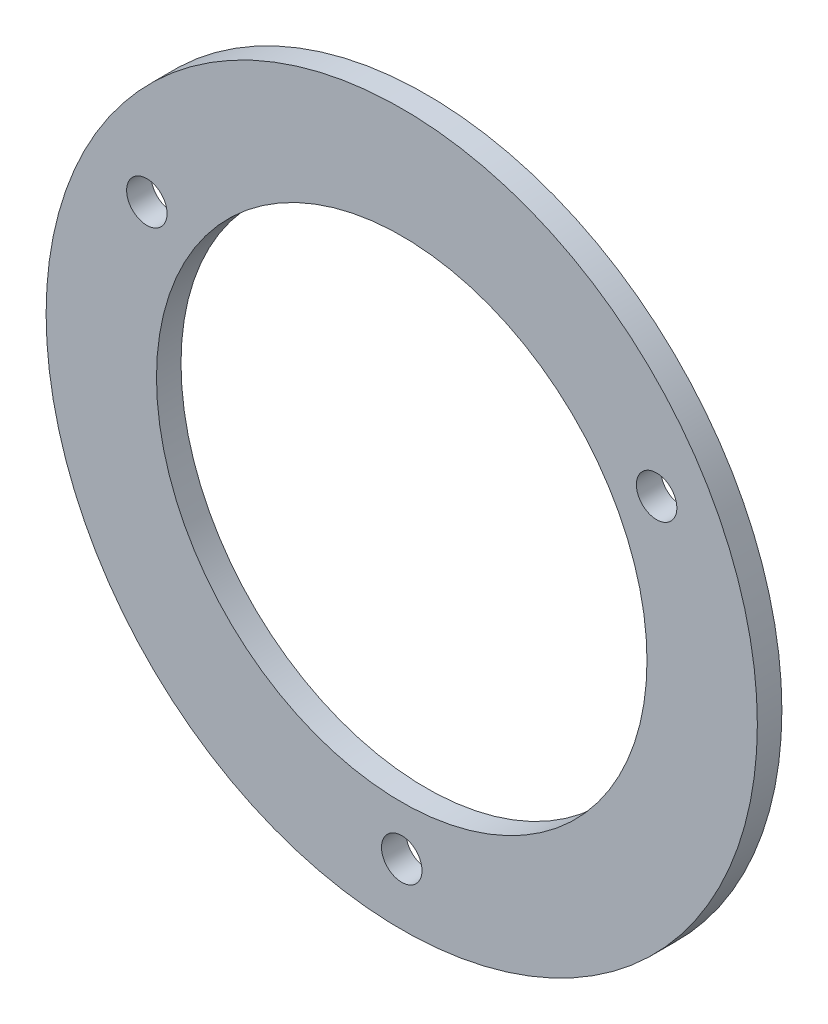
from build123d import *

# Parameters (mm, degrees)
SKETCH_1_R         = 29
SKETCH_1_R_2       = 20
EXTRUDE_1_DEPTH    = 2
HOLE_WIZARD_M4_1_D = 3.3


with BuildPart() as part:
    # Sketch 1 → Extrude 1 (new body)
    with BuildSketch(Plane.XY):
        with Locations((-3, 52)):
            Circle(SKETCH_1_R)
        with Locations((-3, 52)):
            Circle(SKETCH_1_R_2, mode=Mode.SUBTRACT)
    extrude(amount=EXTRUDE_1_DEPTH)

    # Hole Wizard M4 _1 (through all)
    with Locations(Plane.XY.offset(2)):
        with Locations((17.784609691, 64), (-23.784609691, 64), (-3, 28)):
            Hole(HOLE_WIZARD_M4_1_D / 2)


solid = part.part
